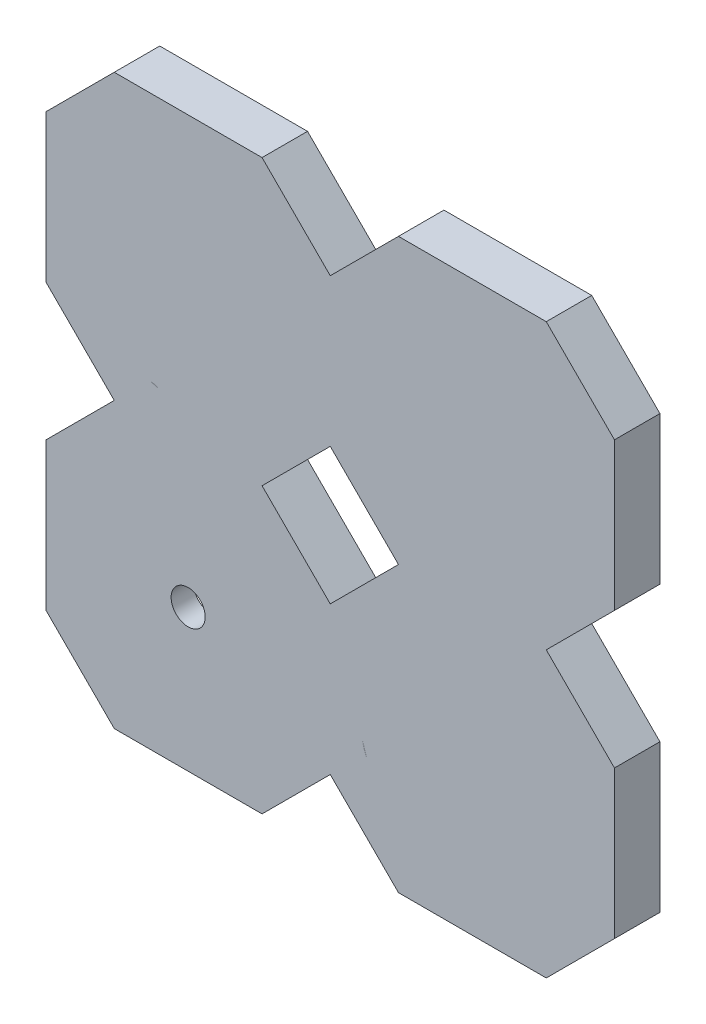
from build123d import *

# Parameters (mm, degrees)
CROQUIS1_R                = 100
CROQUIS1_R_2              = 15
SALIENTE_EXTRUIR1_DEPTH   = 25
SALIENTE_EXTRUIR3_DEPTH   = 40
CROQUIS1_6_R              = 100
SALIENTE_EXTRUIR4_DEPTH   = 5
CROQUIS1_7_R              = 100
CROQUIS1_7_R_2            = 15
SALIENTE_EXTRUIR5_DEPTH   = 25
SALIENTE_EXTRUIR5_2_DEPTH = 25
SALIENTE_EXTRUIR5_3_DEPTH = 25
CROQUIS2_R                = 65
CORTAR_EXTRUIR3_DEPTH     = 5
CROQUIS3_R                = 65
CORTAR_EXTRUIR4_DEPTH     = 5


with BuildPart() as part:
    # Croquis1 → Saliente-Extruir1 (new body)
    with BuildSketch(Plane.XY):
        with Locations((112.5, 58.5)):
            Circle(CROQUIS1_R)
        with Locations((112.5, 58.5)):
            Circle(CROQUIS1_R_2, mode=Mode.SUBTRACT)
    extrude(amount=-SALIENTE_EXTRUIR1_DEPTH)



with BuildPart() as body_2:
    # Croquis1_4 → Saliente-Extruir3 (new body)
    with BuildSketch(Plane.XY):
        Polygon((47.5, -66.5), (177.5, -66.5), (237.5, -6.5), (297.5, -66.5), (427.5, -66.5), (487.5, -6.5), (487.5, 123.5), (427.5, 183.5), (487.5, 243.5), (487.5, 373.5), (427.5, 433.5), (297.5, 433.5), (237.5, 373.5), (177.5, 433.5), (47.5, 433.5), (-12.5, 373.5), (-12.5, 243.5), (47.5, 183.5), (-12.5, 123.5), (-12.5, -6.5), align=None)
        Polygon((177.5, 183.5), (237.5, 123.5), (297.5, 183.5), (237.5, 243.5), align=None, mode=Mode.SUBTRACT)
        Polygon((51.642135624, -56.5), (173.357864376, -56.5), (227.5, -2.357864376), (227.5, 119.357864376), (173.357864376, 173.5), (51.642135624, 173.5), (-2.5, 119.357864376), (-2.5, -2.357864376), align=None, mode=Mode.SUBTRACT)
        Polygon((477.5, -2.357864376), (423.357864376, -56.5), (301.642135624, -56.5), (247.5, -2.357864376), (247.5, 119.357864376), (301.642135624, 173.5), (423.357864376, 173.5), (477.5, 119.357864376), align=None, mode=Mode.SUBTRACT)
        Polygon((423.357864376, 423.5), (301.642135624, 423.5), (247.5, 369.357864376), (247.5, 247.642135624), (301.642135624, 193.5), (423.357864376, 193.5), (477.5, 247.642135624), (477.5, 369.357864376), align=None, mode=Mode.SUBTRACT)
        Polygon((-2.5, 369.357864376), (51.642135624, 423.5), (173.357864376, 423.5), (227.5, 369.357864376), (227.5, 247.642135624), (173.357864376, 193.5), (51.642135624, 193.5), (-2.5, 247.642135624), align=None, mode=Mode.SUBTRACT)
    extrude(amount=-SALIENTE_EXTRUIR3_DEPTH)


with BuildPart() as part_1:
    add(part.part)

    add(body_2.part)  # Saliente-Extruir4 merges body 2
    # Croquis1_6 → Saliente-Extruir4 (add)
    # profile 1 of 4: a face of its own
    with BuildSketch(Plane.XY):
        Polygon((-2.5, 119.357864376), (-2.5, -2.357864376), (51.642135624, -56.5), (173.357864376, -56.5), (227.5, -2.357864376), (227.5, 119.357864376), (173.357864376, 173.5), (51.642135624, 173.5), align=None)
        with Locations((112.5, 58.5)):
            Circle(CROQUIS1_6_R, mode=Mode.SUBTRACT)
    # profile 2 of 4: a face of its own
    with BuildSketch(Plane.XY):
        Polygon((477.5, -2.357864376), (423.357864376, -56.5), (301.642135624, -56.5), (247.5, -2.357864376), (247.5, 119.357864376), (301.642135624, 173.5), (423.357864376, 173.5), (477.5, 119.357864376), align=None)
    # profile 3 of 4: a face of its own
    with BuildSketch(Plane.XY):
        Polygon((423.357864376, 423.5), (301.642135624, 423.5), (247.5, 369.357864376), (247.5, 247.642135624), (301.642135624, 193.5), (423.357864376, 193.5), (477.5, 247.642135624), (477.5, 369.357864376), align=None)
    # profile 4 of 4: a face of its own
    with BuildSketch(Plane.XY):
        Polygon((-2.5, 369.357864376), (51.642135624, 423.5), (173.357864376, 423.5), (227.5, 369.357864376), (227.5, 247.642135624), (173.357864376, 193.5), (51.642135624, 193.5), (-2.5, 247.642135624), align=None)
    extrude(amount=-SALIENTE_EXTRUIR4_DEPTH)

    # Croquis2 → Cortar-Extruir3 (cut)
    with BuildSketch(Plane(origin=(0, 0, -25), x_dir=(-1, 0, 0), z_dir=(0, 0, -1))):
        with Locations((-112.5, 58.5)):
            Circle(CROQUIS2_R)
    extrude(amount=-CORTAR_EXTRUIR3_DEPTH, mode=Mode.SUBTRACT)


with BuildPart() as body_2_2:
    # Croquis1_7 → Saliente-Extruir5 (new body)
    with BuildSketch(Plane.XY):
        with Locations((362.5, 58.5)):
            Circle(CROQUIS1_7_R)
        with Locations((362.5, 58.5)):
            Circle(CROQUIS1_7_R_2, mode=Mode.SUBTRACT)
    extrude(amount=-SALIENTE_EXTRUIR5_DEPTH)


with BuildPart() as body_3:
    # Croquis1_7 → Saliente-Extruir5 2 (new body)
    with BuildSketch(Plane.XY):
        with Locations((362.5, 308.5)):
            Circle(CROQUIS1_7_R)
        with Locations((362.5, 308.5)):
            Circle(CROQUIS1_7_R_2, mode=Mode.SUBTRACT)
    extrude(amount=-SALIENTE_EXTRUIR5_2_DEPTH)


with BuildPart() as body_4:
    # Croquis1_7 → Saliente-Extruir5 3 (new body)
    with BuildSketch(Plane.XY):
        with Locations((112.5, 308.5)):
            Circle(CROQUIS1_7_R)
        with Locations((112.5, 308.5)):
            Circle(CROQUIS1_7_R_2, mode=Mode.SUBTRACT)
    extrude(amount=-SALIENTE_EXTRUIR5_3_DEPTH)


with BuildPart() as cortar_extruir4_tool:
    # Croquis3 → Cortar-Extruir4 (new body)
    with BuildSketch(Plane(origin=(0, 0, -25), x_dir=(-1, 0, 0), z_dir=(0, 0, -1))):
        with Locations((-362.5, 58.5)):
            Circle(CROQUIS3_R)
        with Locations((-362.5, 308.5)):
            Circle(CROQUIS3_R)
        with Locations((-112.5, 308.5)):
            Circle(CROQUIS3_R)
    extrude(amount=-CORTAR_EXTRUIR4_DEPTH)


with BuildPart() as body_2_2_1:
    add(body_2_2.part)

    # Cortar-Extruir4: cut by cortar_extruir4_tool
    add(cortar_extruir4_tool.part, mode=Mode.SUBTRACT)


with BuildPart() as body_3_1:
    add(body_3.part)

    # Cortar-Extruir4: cut by cortar_extruir4_tool
    add(cortar_extruir4_tool.part, mode=Mode.SUBTRACT)


with BuildPart() as body_4_1:
    add(body_4.part)

    # Cortar-Extruir4: cut by cortar_extruir4_tool
    add(cortar_extruir4_tool.part, mode=Mode.SUBTRACT)


solid = Compound([part_1.part, body_2_2_1.part, body_3_1.part, body_4_1.part])
